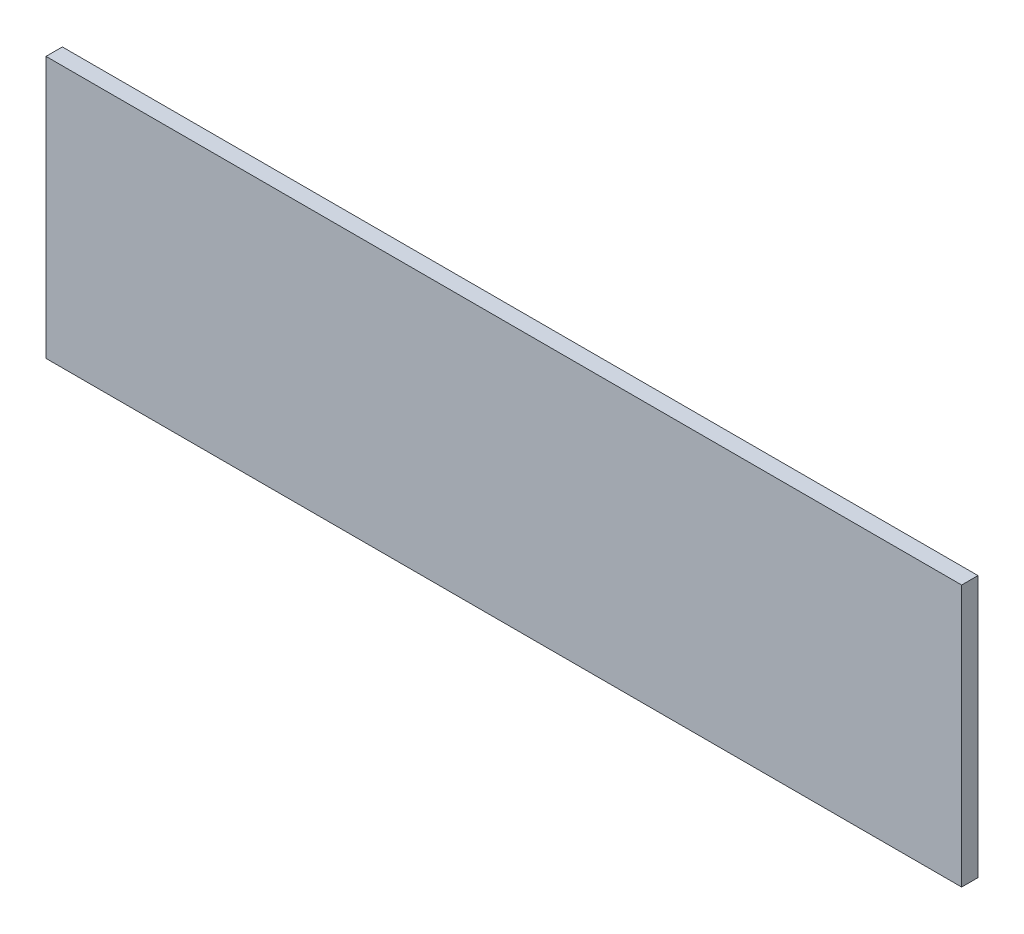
from build123d import *

# Parameters (mm, degrees)
ESQUISSE1_W          = 280
ESQUISSE1_H          = 80
BASE_EXTRUSION_DEPTH = 5


with BuildPart() as part:
    # Esquisse1 → Base-Extrusion (new body)
    with BuildSketch(Plane.XY):
        with Locations((140, 40)):
            Rectangle(ESQUISSE1_W, ESQUISSE1_H)
    extrude(amount=BASE_EXTRUSION_DEPTH)


solid = part.part
